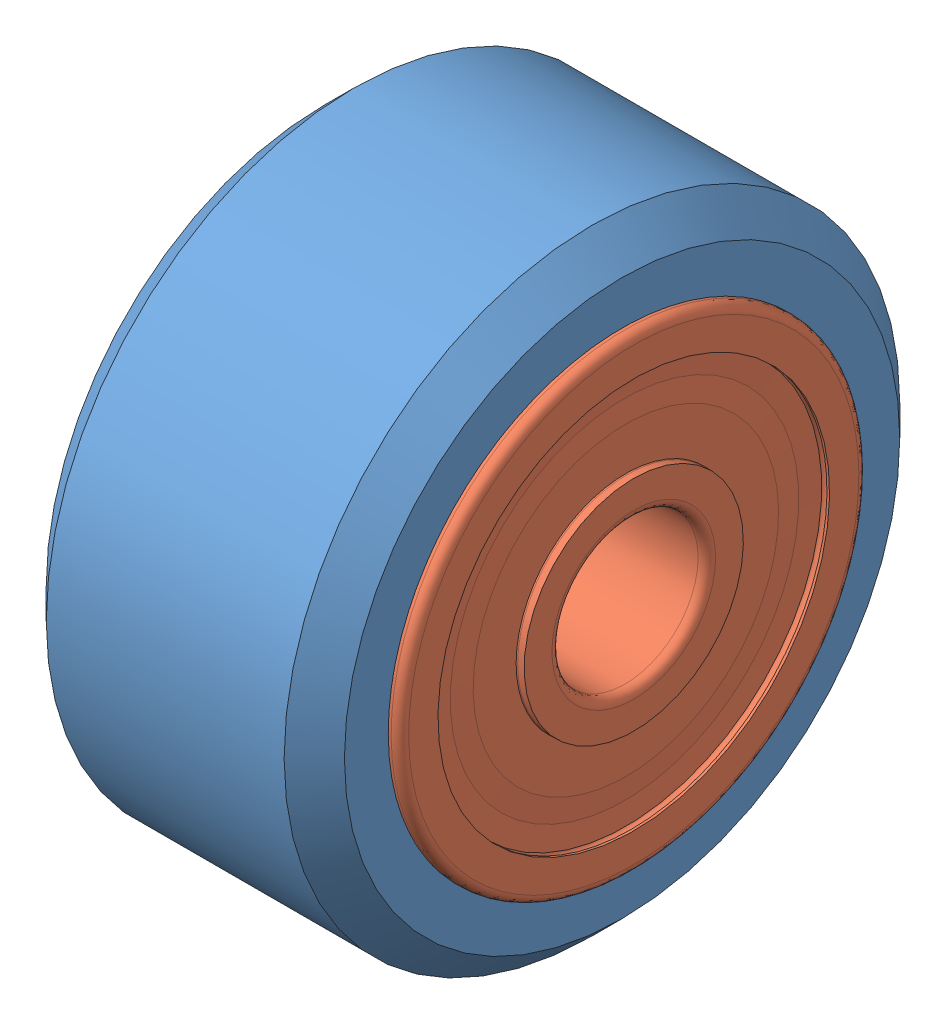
SolidWorks assembly v wheel.SLDASM, configuration Default (file format 9000). Lengths in mm.
Overall size (11 21.99 21.99).
3 component instances, 2 part files, 4 mates.
Components (placement in the parent):
- v wheel outer cover-1: v wheel outer cover.SLDPRT [Default] at (5.3844 11.4744 17.147) size (10.2 21.06 21.06)
- W 625-2RS1-1: W 625-2RS1.SLDPRT [Default] at (5.8844 11.4744 17.147) x (1 0 0) z (0 0.854321 -0.519745) size (5 16 16)
- W 625-2RS1-2: W 625-2RS1.SLDPRT [Default] at (-0.1156 11.4744 17.147) size (5 16 16)
Mates (geometry in assembly coordinates):
- Concentric1: concentric aligned: cylinder of v wheel outer cover-1 through (5.3844 11.4744 17.147) axis (1 0 0) radius 10.5314; cylinder of W 625-2RS1-1 through (55.8844 11.4744 17.147) axis (1 0 0) radius 8
- Coincident1: coincident aligned: plane of v wheel outer cover-1 through (5.8844 18.4744 17.147) normal (1 0 0); circle of W 625-2RS1-1
- Concentric2: concentric aligned: cylinder of v wheel outer cover-1 through (5.3844 11.4744 17.147) axis (1 0 0) radius 10.5314; cylinder of W 625-2RS1-2 through (49.8844 11.4744 17.147) axis (1 0 0) radius 8
- Coincident2: coincident anti-aligned: plane of v wheel outer cover-1 through (4.8844 18.4744 17.147) normal (-1 0 0); plane of W 625-2RS1-2 through (4.8844 18.1744 17.147) normal (1 0 0)
